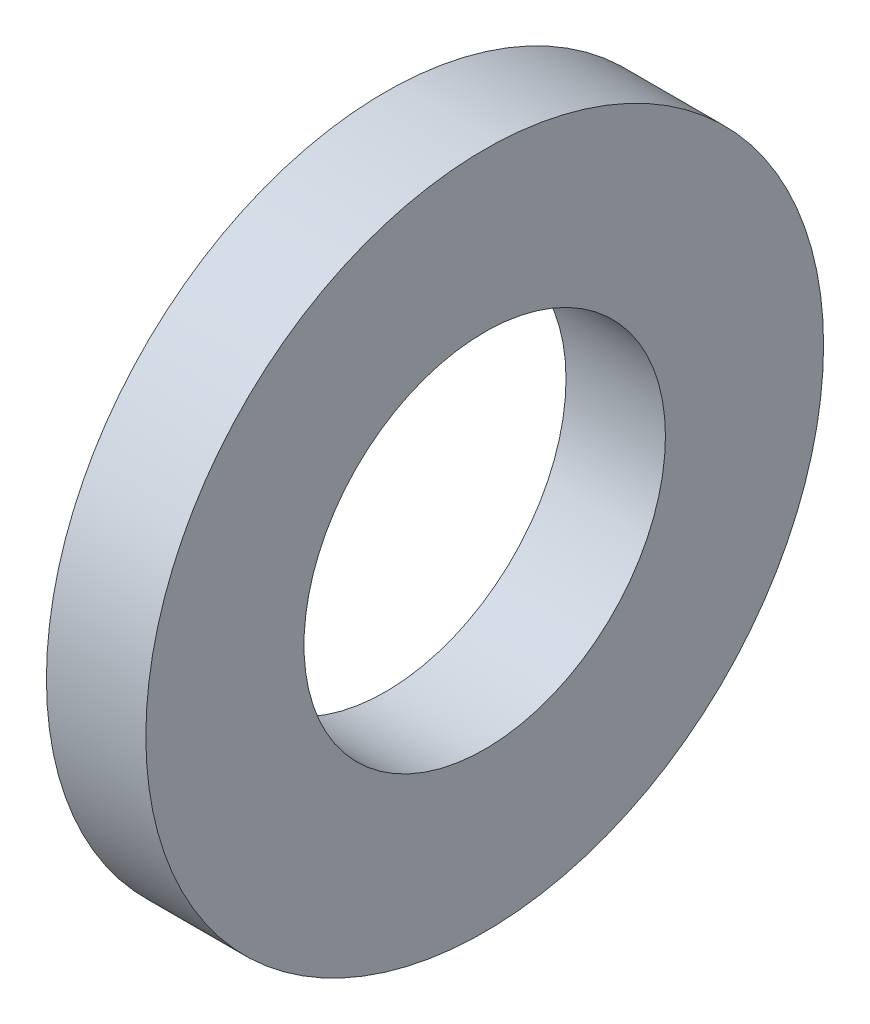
ISO-10303-21;
HEADER;
FILE_DESCRIPTION(('STEP AP214'),'2;1');
FILE_NAME('part.step','',(''),(''),'','','');
FILE_SCHEMA(('AUTOMOTIVE_DESIGN { 1 0 10303 214 1 1 1 1 }'));
ENDSEC;
DATA;
#1=APPLICATION_CONTEXT('core data for automotive mechanical design processes');
#2=APPLICATION_PROTOCOL_DEFINITION('international standard','automotive_design',2000,#1);
#3=PRODUCT_CONTEXT('',#1,'mechanical');
#4=PRODUCT('Part','Part','',(#3));
#5=PRODUCT_RELATED_PRODUCT_CATEGORY('part','',(#4));
#6=PRODUCT_DEFINITION_FORMATION('','',#4);
#7=PRODUCT_DEFINITION_CONTEXT('part definition',#1,'design');
#8=PRODUCT_DEFINITION('design','',#6,#7);
#9=PRODUCT_DEFINITION_SHAPE('','',#8);
#10=(LENGTH_UNIT() NAMED_UNIT(*) SI_UNIT(.MILLI.,.METRE.));
#11=(NAMED_UNIT(*) PLANE_ANGLE_UNIT() SI_UNIT($,.RADIAN.));
#12=(NAMED_UNIT(*) SI_UNIT($,.STERADIAN.) SOLID_ANGLE_UNIT());
#13=UNCERTAINTY_MEASURE_WITH_UNIT(LENGTH_MEASURE(1.E-05),#10,'distance_accuracy_value','');
#14=(GEOMETRIC_REPRESENTATION_CONTEXT(3) GLOBAL_UNCERTAINTY_ASSIGNED_CONTEXT((#13)) GLOBAL_UNIT_ASSIGNED_CONTEXT((#10,
#11,#12)) REPRESENTATION_CONTEXT('',''));
#15=CARTESIAN_POINT('',(0.,0.,0.));
#16=DIRECTION('',(0.,0.,1.));
#17=DIRECTION('',(1.,0.,0.));
#18=AXIS2_PLACEMENT_3D('',#15,#16,#17);
#19=CARTESIAN_POINT('',(2.2,0.,0.));
#20=DIRECTION('',(1.,0.,0.));
#21=DIRECTION('',(0.,0.,-1.));
#22=AXIS2_PLACEMENT_3D('',#19,#20,#21);
#23=PLANE('',#22);
#24=CARTESIAN_POINT('',(2.2,0.,0.));
#25=DIRECTION('',(1.,0.,0.));
#26=DIRECTION('',(0.,0.,-1.));
#27=AXIS2_PLACEMENT_3D('',#24,#25,#26);
#28=CIRCLE('',#27,4.);
#29=CARTESIAN_POINT('',(2.2,0.,-4.));
#30=VERTEX_POINT('',#29);
#31=EDGE_CURVE('E26',#30,#30,#28,.F.);
#32=ORIENTED_EDGE('',*,*,#31,.T.);
#33=EDGE_LOOP('',(#32));
#34=FACE_BOUND('',#33,.T.);
#35=CARTESIAN_POINT('',(2.2,0.,0.));
#36=DIRECTION('',(1.,0.,0.));
#37=DIRECTION('',(0.,0.,-1.));
#38=AXIS2_PLACEMENT_3D('',#35,#36,#37);
#39=CIRCLE('',#38,7.5);
#40=CARTESIAN_POINT('',(2.2,0.,-7.5));
#41=VERTEX_POINT('',#40);
#42=EDGE_CURVE('E17',#41,#41,#39,.F.);
#43=ORIENTED_EDGE('',*,*,#42,.F.);
#44=EDGE_LOOP('',(#43));
#45=FACE_BOUND('',#44,.T.);
#46=ADVANCED_FACE('F14',(#34,#45),#23,.T.);
#47=CARTESIAN_POINT('',(1.1,0.,0.));
#48=DIRECTION('',(1.,0.,0.));
#49=DIRECTION('',(0.,0.,-1.));
#50=AXIS2_PLACEMENT_3D('',#47,#48,#49);
#51=CYLINDRICAL_SURFACE('',#50,7.5);
#52=CARTESIAN_POINT('',(0.,0.,0.));
#53=DIRECTION('',(1.,0.,0.));
#54=DIRECTION('',(0.,0.,-1.));
#55=AXIS2_PLACEMENT_3D('',#52,#53,#54);
#56=CIRCLE('',#55,7.5);
#57=CARTESIAN_POINT('',(0.,0.,-7.5));
#58=VERTEX_POINT('',#57);
#59=EDGE_CURVE('E21',#58,#58,#56,.T.);
#60=ORIENTED_EDGE('',*,*,#59,.T.);
#61=EDGE_LOOP('',(#60));
#62=FACE_BOUND('',#61,.T.);
#63=ORIENTED_EDGE('',*,*,#42,.T.);
#64=EDGE_LOOP('',(#63));
#65=FACE_BOUND('',#64,.T.);
#66=ADVANCED_FACE('F34',(#62,#65),#51,.T.);
#67=CARTESIAN_POINT('',(1.1,0.,0.));
#68=DIRECTION('',(1.,0.,0.));
#69=DIRECTION('',(0.,0.,-1.));
#70=AXIS2_PLACEMENT_3D('',#67,#68,#69);
#71=CYLINDRICAL_SURFACE('',#70,4.);
#72=CARTESIAN_POINT('',(0.,0.,0.));
#73=DIRECTION('',(1.,0.,0.));
#74=DIRECTION('',(0.,0.,-1.));
#75=AXIS2_PLACEMENT_3D('',#72,#73,#74);
#76=CIRCLE('',#75,4.);
#77=CARTESIAN_POINT('',(0.,0.,-4.));
#78=VERTEX_POINT('',#77);
#79=EDGE_CURVE('E10',#78,#78,#76,.F.);
#80=ORIENTED_EDGE('',*,*,#79,.T.);
#81=EDGE_LOOP('',(#80));
#82=FACE_BOUND('',#81,.T.);
#83=ORIENTED_EDGE('',*,*,#31,.F.);
#84=EDGE_LOOP('',(#83));
#85=FACE_BOUND('',#84,.T.);
#86=ADVANCED_FACE('F41',(#82,#85),#71,.F.);
#87=CARTESIAN_POINT('',(0.,0.,0.));
#88=DIRECTION('',(1.,0.,0.));
#89=DIRECTION('',(0.,0.,-1.));
#90=AXIS2_PLACEMENT_3D('',#87,#88,#89);
#91=PLANE('',#90);
#92=ORIENTED_EDGE('',*,*,#79,.F.);
#93=EDGE_LOOP('',(#92));
#94=FACE_BOUND('',#93,.T.);
#95=ORIENTED_EDGE('',*,*,#59,.F.);
#96=EDGE_LOOP('',(#95));
#97=FACE_BOUND('',#96,.T.);
#98=ADVANCED_FACE('F43',(#94,#97),#91,.F.);
#99=CLOSED_SHELL('',(#46,#66,#86,#98));
#100=MANIFOLD_SOLID_BREP('B1',#99);
#101=ADVANCED_BREP_SHAPE_REPRESENTATION('',(#18,#100),#14);
#102=SHAPE_DEFINITION_REPRESENTATION(#9,#101);
ENDSEC;
END-ISO-10303-21;
